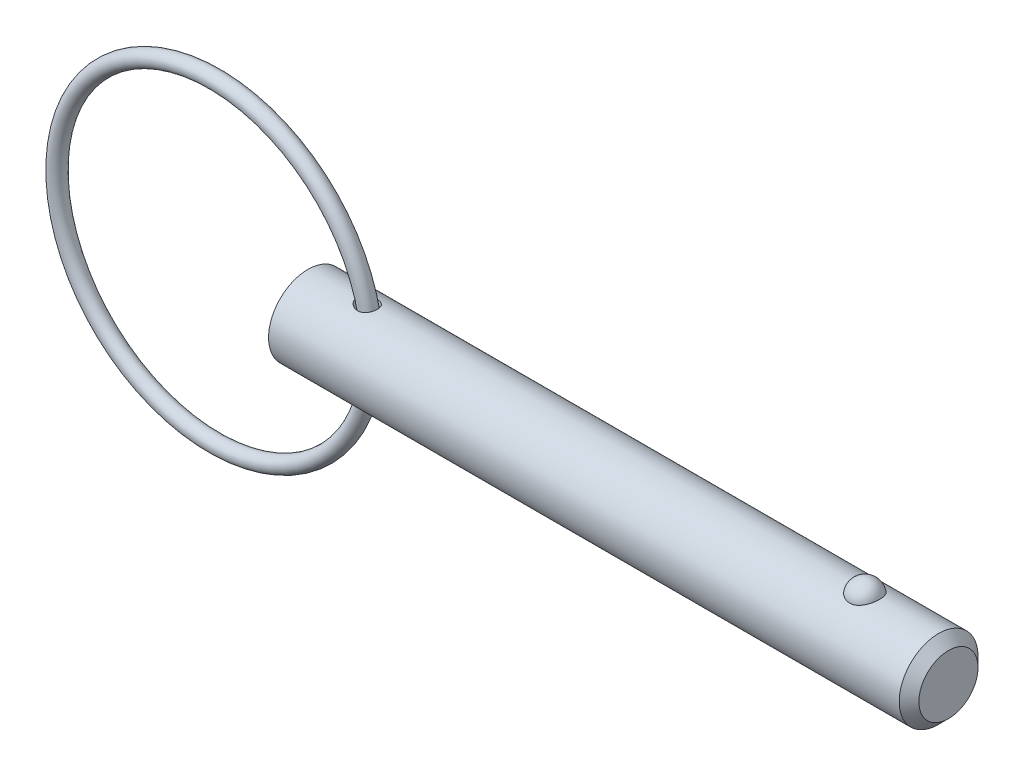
ISO-10303-21;
HEADER;
FILE_DESCRIPTION(('STEP AP214'),'2;1');
FILE_NAME('part.step','',(''),(''),'','','');
FILE_SCHEMA(('AUTOMOTIVE_DESIGN { 1 0 10303 214 1 1 1 1 }'));
ENDSEC;
DATA;
#1=APPLICATION_CONTEXT('core data for automotive mechanical design processes');
#2=APPLICATION_PROTOCOL_DEFINITION('international standard','automotive_design',2000,#1);
#3=PRODUCT_CONTEXT('',#1,'mechanical');
#4=PRODUCT('Part','Part','',(#3));
#5=PRODUCT_RELATED_PRODUCT_CATEGORY('part','',(#4));
#6=PRODUCT_DEFINITION_FORMATION('','',#4);
#7=PRODUCT_DEFINITION_CONTEXT('part definition',#1,'design');
#8=PRODUCT_DEFINITION('design','',#6,#7);
#9=PRODUCT_DEFINITION_SHAPE('','',#8);
#10=(LENGTH_UNIT() NAMED_UNIT(*) SI_UNIT(.MILLI.,.METRE.));
#11=(NAMED_UNIT(*) PLANE_ANGLE_UNIT() SI_UNIT($,.RADIAN.));
#12=(NAMED_UNIT(*) SI_UNIT($,.STERADIAN.) SOLID_ANGLE_UNIT());
#13=UNCERTAINTY_MEASURE_WITH_UNIT(LENGTH_MEASURE(1.E-05),#10,'distance_accuracy_value','');
#14=(GEOMETRIC_REPRESENTATION_CONTEXT(3) GLOBAL_UNCERTAINTY_ASSIGNED_CONTEXT((#13)) GLOBAL_UNIT_ASSIGNED_CONTEXT((#10,
#11,#12)) REPRESENTATION_CONTEXT('',''));
#15=CARTESIAN_POINT('',(0.,0.,0.));
#16=DIRECTION('',(0.,0.,1.));
#17=DIRECTION('',(1.,0.,0.));
#18=AXIS2_PLACEMENT_3D('',#15,#16,#17);
#19=CARTESIAN_POINT('',(-7.52490236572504,0.,0.));
#20=DIRECTION('',(0.,0.,1.));
#21=DIRECTION('',(1.,0.,0.));
#22=AXIS2_PLACEMENT_3D('',#19,#20,#21);
#23=TOROIDAL_SURFACE('',#22,12.7,0.635000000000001);
#24=CARTESIAN_POINT('',(5.81009763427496,0.,0.));
#25=VERTEX_POINT('',#24);
#26=VERTEX_LOOP('',#25);
#27=FACE_BOUND('',#26,.T.);
#28=ADVANCED_FACE('P0_F12',(#27),#23,.T.);
#29=CLOSED_SHELL('',(#28));
#30=MANIFOLD_SOLID_BREP('P0_B1',#29);
#31=CARTESIAN_POINT('',(0.,0.,0.));
#32=DIRECTION('',(1.,0.,0.));
#33=DIRECTION('',(0.,0.,-1.));
#34=AXIS2_PLACEMENT_3D('',#31,#32,#33);
#35=CYLINDRICAL_SURFACE('',#34,3.175);
#36=CARTESIAN_POINT('',(4.01221718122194,3.16142308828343,-0.293307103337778));
#37=CARTESIAN_POINT('',(4.03067993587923,3.15750982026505,-0.335477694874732));
#38=CARTESIAN_POINT('',(4.05297703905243,3.15289835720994,-0.375943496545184));
#39=CARTESIAN_POINT('',(4.10415276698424,3.14284099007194,-0.452407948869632));
#40=CARTESIAN_POINT('',(4.1330447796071,3.13739339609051,-0.488397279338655));
#41=CARTESIAN_POINT('',(4.19615348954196,3.12629932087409,-0.554988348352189));
#42=CARTESIAN_POINT('',(4.23034557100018,3.12065384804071,-0.585613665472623));
#43=CARTESIAN_POINT('',(4.3031328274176,3.10972452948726,-0.641123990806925));
#44=CARTESIAN_POINT('',(4.34172706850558,3.10444060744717,-0.666010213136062));
#45=CARTESIAN_POINT('',(4.42517725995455,3.09444053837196,-0.711079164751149));
#46=CARTESIAN_POINT('',(4.47028158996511,3.08978882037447,-0.730818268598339));
#47=CARTESIAN_POINT('',(4.56327045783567,3.08209858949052,-0.762602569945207));
#48=CARTESIAN_POINT('',(4.61115533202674,3.07906027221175,-0.774646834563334));
#49=CARTESIAN_POINT('',(4.70827322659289,3.0750396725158,-0.790458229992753));
#50=CARTESIAN_POINT('',(4.75750323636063,3.07405312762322,-0.79424252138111));
#51=CARTESIAN_POINT('',(4.85586074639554,3.07433427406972,-0.793155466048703));
#52=CARTESIAN_POINT('',(4.90498828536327,3.07560084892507,-0.788288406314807));
#53=CARTESIAN_POINT('',(4.99830385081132,3.08013122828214,-0.770385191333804));
#54=CARTESIAN_POINT('',(5.04260499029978,3.08325928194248,-0.757902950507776));
#55=CARTESIAN_POINT('',(5.1282462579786,3.09104671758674,-0.725486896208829));
#56=CARTESIAN_POINT('',(5.16958706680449,3.09570574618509,-0.705554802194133));
#57=CARTESIAN_POINT('',(5.24627719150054,3.10576748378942,-0.65981371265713));
#58=CARTESIAN_POINT('',(5.28181038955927,3.11112830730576,-0.634302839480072));
#59=CARTESIAN_POINT('',(5.34802604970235,3.12213947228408,-0.57766778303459));
#60=CARTESIAN_POINT('',(5.37870854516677,3.1277898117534,-0.546543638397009));
#61=CARTESIAN_POINT('',(5.43445707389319,3.13876145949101,-0.479533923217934));
#62=CARTESIAN_POINT('',(5.45951927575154,3.14408254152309,-0.443645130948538));
#63=CARTESIAN_POINT('',(5.50339935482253,3.15381660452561,-0.368122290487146));
#64=CARTESIAN_POINT('',(5.52221691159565,3.15822953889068,-0.328488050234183));
#65=CARTESIAN_POINT('',(5.55335622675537,3.16572312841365,-0.246075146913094));
#66=CARTESIAN_POINT('',(5.56559711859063,3.16878711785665,-0.203264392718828));
#67=CARTESIAN_POINT('',(5.58294807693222,3.17317503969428,-0.116135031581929));
#68=CARTESIAN_POINT('',(5.58805800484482,3.17449893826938,-0.0718163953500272));
#69=CARTESIAN_POINT('',(5.59103306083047,3.17526647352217,0.0172340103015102));
#70=CARTESIAN_POINT('',(5.58887304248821,3.17470358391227,0.0619666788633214));
#71=CARTESIAN_POINT('',(5.57730300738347,3.17174350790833,0.15042284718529));
#72=CARTESIAN_POINT('',(5.56789286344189,3.16934628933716,0.1941463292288));
#73=CARTESIAN_POINT('',(5.54204285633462,3.16297605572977,0.279344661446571));
#74=CARTESIAN_POINT('',(5.52560272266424,3.15900298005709,0.320819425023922));
#75=CARTESIAN_POINT('',(5.4860820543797,3.14991364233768,0.400340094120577));
#76=CARTESIAN_POINT('',(5.46300145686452,3.14479736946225,0.438385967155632));
#77=CARTESIAN_POINT('',(5.41080575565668,3.1339965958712,0.509900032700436));
#78=CARTESIAN_POINT('',(5.3817004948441,3.12831302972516,0.54337554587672));
#79=CARTESIAN_POINT('',(5.31818122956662,3.11701107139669,0.604852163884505));
#80=CARTESIAN_POINT('',(5.2837678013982,3.11139267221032,0.632853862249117));
#81=CARTESIAN_POINT('',(5.21096127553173,3.10091904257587,0.682320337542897));
#82=CARTESIAN_POINT('',(5.1726139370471,3.09605639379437,0.703850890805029));
#83=CARTESIAN_POINT('',(5.09274050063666,3.08756769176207,0.740203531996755));
#84=CARTESIAN_POINT('',(5.05121474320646,3.08394150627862,0.755026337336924));
#85=CARTESIAN_POINT('',(4.9665065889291,3.07833156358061,0.777582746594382));
#86=CARTESIAN_POINT('',(4.92333841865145,3.07633606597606,0.785367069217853));
#87=CARTESIAN_POINT('',(4.83627503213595,3.07411756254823,0.794006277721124));
#88=CARTESIAN_POINT('',(4.79237971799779,3.07389479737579,0.794860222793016));
#89=CARTESIAN_POINT('',(4.70375644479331,3.0752087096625,0.789761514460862));
#90=CARTESIAN_POINT('',(4.65904075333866,3.07679607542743,0.783612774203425));
#91=CARTESIAN_POINT('',(4.57116325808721,3.08158486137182,0.764561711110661));
#92=CARTESIAN_POINT('',(4.52800197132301,3.08478681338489,0.751657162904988));
#93=CARTESIAN_POINT('',(4.44149370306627,3.09268658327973,0.718486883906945));
#94=CARTESIAN_POINT('',(4.39831651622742,3.0974680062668,0.697797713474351));
#95=CARTESIAN_POINT('',(4.31591226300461,3.10789270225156,0.649792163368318));
#96=CARTESIAN_POINT('',(4.27668695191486,3.11353635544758,0.622472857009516));
#97=CARTESIAN_POINT('',(4.20182407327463,3.1252888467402,0.560557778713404));
#98=CARTESIAN_POINT('',(4.16638921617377,3.13140725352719,0.525717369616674));
#99=CARTESIAN_POINT('',(4.10227951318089,3.14315144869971,0.450199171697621));
#100=CARTESIAN_POINT('',(4.0736023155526,3.14877740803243,0.409523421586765));
#101=CARTESIAN_POINT('',(4.02575866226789,3.15851130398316,0.325741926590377));
#102=CARTESIAN_POINT('',(4.00615248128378,3.16268619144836,0.282896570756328));
#103=CARTESIAN_POINT('',(3.97532986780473,3.16936826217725,0.194163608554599));
#104=CARTESIAN_POINT('',(3.96410589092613,3.17187694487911,0.148278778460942));
#105=CARTESIAN_POINT('',(3.95155037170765,3.17469339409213,0.0604600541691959));
#106=CARTESIAN_POINT('',(3.9492378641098,3.17521926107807,0.0186712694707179));
#107=CARTESIAN_POINT('',(3.95191506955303,3.1746144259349,-0.0646295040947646));
#108=CARTESIAN_POINT('',(3.9568961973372,3.17348567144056,-0.10614176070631));
#109=CARTESIAN_POINT('',(3.97060099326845,3.17043701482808,-0.172031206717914));
#110=CARTESIAN_POINT('',(3.97717137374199,3.16898333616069,-0.196902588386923));
#111=CARTESIAN_POINT('',(3.99283717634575,3.16556630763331,-0.245794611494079));
#112=CARTESIAN_POINT('',(4.00193224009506,3.16360303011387,-0.269815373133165));
#113=CARTESIAN_POINT('',(4.01221718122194,3.16142308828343,-0.293307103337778));
#114=B_SPLINE_CURVE_WITH_KNOTS('',3,(#36,#37,#38,#39,#40,#41,#42,#43,#44,#45,#46,#47,#48,#49,
#50,#51,#52,#53,#54,#55,#56,#57,#58,#59,#60,#61,#62,#63,#64,#65,#66,#67,#68,#69,#70,#71,#72,#73,
#74,#75,#76,#77,#78,#79,#80,#81,#82,#83,#84,#85,#86,#87,#88,#89,#90,#91,#92,#93,#94,#95,#96,#97,
#98,#99,#100,#101,#102,#103,#104,#105,#106,#107,#108,#109,#110,#111,#112,#113),.UNSPECIFIED.,
.T.,.F.,(4,2,2,2,2,2,2,2,2,2,2,2,2,2,2,2,2,2,2,2,2,2,2,2,2,2,2,2,2,2,2,2,2,2,2,2,2,2,4),(0.,
0.138498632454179,0.277280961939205,0.415437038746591,0.553563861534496,0.701231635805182,
0.848917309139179,0.996295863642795,1.14360140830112,1.28129260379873,1.41895203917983,
1.55053732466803,1.68212170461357,1.81379551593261,1.94547608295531,2.07874074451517,
2.21200799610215,2.34573668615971,2.47946772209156,2.61320390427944,2.74694135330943,
2.8804620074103,3.01396817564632,3.14606745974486,3.27815261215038,3.40927820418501,
3.54042159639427,3.6753294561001,3.81028178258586,3.95399377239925,4.09776931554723,
4.24721954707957,4.39661769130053,4.53771923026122,4.67869361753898,4.8036143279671,
4.92838811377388,5.00555170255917,5.08270434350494),.UNSPECIFIED.);
#115=CARTESIAN_POINT('',(4.01221718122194,3.16142308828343,-0.293307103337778));
#116=VERTEX_POINT('',#115);
#117=EDGE_CURVE('P1_E40',#116,#116,#114,.T.);
#118=ORIENTED_EDGE('',*,*,#117,.T.);
#119=EDGE_LOOP('',(#118));
#120=FACE_BOUND('',#119,.T.);
#121=CARTESIAN_POINT('',(50.81625,0.,0.));
#122=DIRECTION('',(1.,0.,0.));
#123=DIRECTION('',(0.,0.,-1.));
#124=AXIS2_PLACEMENT_3D('',#121,#122,#123);
#125=CIRCLE('',#124,3.175);
#126=CARTESIAN_POINT('',(50.81625,0.,-3.175));
#127=VERTEX_POINT('',#126);
#128=EDGE_CURVE('P1_E25',#127,#127,#125,.T.);
#129=ORIENTED_EDGE('',*,*,#128,.F.);
#130=EDGE_LOOP('',(#129));
#131=FACE_BOUND('',#130,.T.);
#132=CARTESIAN_POINT('',(0.,0.,0.));
#133=DIRECTION('',(1.,0.,0.));
#134=DIRECTION('',(0.,0.,-1.));
#135=AXIS2_PLACEMENT_3D('',#132,#133,#134);
#136=CIRCLE('',#135,3.175);
#137=CARTESIAN_POINT('',(0.,0.,-3.175));
#138=VERTEX_POINT('',#137);
#139=EDGE_CURVE('P1_E9',#138,#138,#136,.T.);
#140=ORIENTED_EDGE('',*,*,#139,.T.);
#141=EDGE_LOOP('',(#140));
#142=FACE_BOUND('',#141,.T.);
#143=CARTESIAN_POINT('',(44.8757276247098,2.92898950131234,1.2254164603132));
#144=CARTESIAN_POINT('',(44.812316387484,2.92899434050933,1.22541146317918));
#145=CARTESIAN_POINT('',(44.7487979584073,2.93112688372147,1.22034641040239));
#146=CARTESIAN_POINT('',(44.6235306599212,2.93942752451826,1.2002094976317));
#147=CARTESIAN_POINT('',(44.5617869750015,2.9456063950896,1.1851109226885));
#148=CARTESIAN_POINT('',(44.4420651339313,2.96127115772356,1.14540352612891));
#149=CARTESIAN_POINT('',(44.3840775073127,2.97074831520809,1.12081980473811));
#150=CARTESIAN_POINT('',(44.2731943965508,2.99197584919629,1.06285154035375));
#151=CARTESIAN_POINT('',(44.2202966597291,3.0037252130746,1.02947091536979));
#152=CARTESIAN_POINT('',(44.1192688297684,3.02865714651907,0.95367409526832));
#153=CARTESIAN_POINT('',(44.071324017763,3.04187163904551,0.911021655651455));
#154=CARTESIAN_POINT('',(43.9830360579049,3.06808741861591,0.818400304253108));
#155=CARTESIAN_POINT('',(43.9426952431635,3.08108863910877,0.768429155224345));
#156=CARTESIAN_POINT('',(43.8688039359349,3.10614903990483,0.660064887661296));
#157=CARTESIAN_POINT('',(43.8356330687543,3.11814104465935,0.60139688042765));
#158=CARTESIAN_POINT('',(43.7791190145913,3.13926931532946,0.479026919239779));
#159=CARTESIAN_POINT('',(43.7557764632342,3.14840539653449,0.415324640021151));
#160=CARTESIAN_POINT('',(43.7191785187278,3.16298160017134,0.283885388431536));
#161=CARTESIAN_POINT('',(43.7060407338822,3.16837855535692,0.216110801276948));
#162=CARTESIAN_POINT('',(43.6905676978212,3.17475386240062,0.0791367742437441));
#163=CARTESIAN_POINT('',(43.688232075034,3.17573236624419,0.00993738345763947));
#164=CARTESIAN_POINT('',(43.694388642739,3.17318075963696,-0.127420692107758));
#165=CARTESIAN_POINT('',(43.7028073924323,3.16968122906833,-0.195583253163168));
#166=CARTESIAN_POINT('',(43.7301752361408,3.1585790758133,-0.329413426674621));
#167=CARTESIAN_POINT('',(43.7491245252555,3.15097637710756,-0.395080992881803));
#168=CARTESIAN_POINT('',(43.7972057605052,3.13242485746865,-0.522180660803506));
#169=CARTESIAN_POINT('',(43.8263524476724,3.12147119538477,-0.583606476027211));
#170=CARTESIAN_POINT('',(43.8942352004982,3.09734973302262,-0.700436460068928));
#171=CARTESIAN_POINT('',(43.932972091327,3.08418174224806,-0.7558401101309));
#172=CARTESIAN_POINT('',(44.0194771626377,3.05694884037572,-0.859404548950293));
#173=CARTESIAN_POINT('',(44.0672961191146,3.04287919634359,-0.90752174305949));
#174=CARTESIAN_POINT('',(44.1707353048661,3.01548927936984,-0.994758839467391));
#175=CARTESIAN_POINT('',(44.2263549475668,3.0021689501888,-1.03387941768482));
#176=CARTESIAN_POINT('',(44.3428093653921,2.97810316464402,-1.10126594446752));
#177=CARTESIAN_POINT('',(44.4035182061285,2.96731170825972,-1.12973256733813));
#178=CARTESIAN_POINT('',(44.5293712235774,2.94928934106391,-1.17598467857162));
#179=CARTESIAN_POINT('',(44.5945137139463,2.94205708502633,-1.19377420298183));
#180=CARTESIAN_POINT('',(44.7238562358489,2.93233065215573,-1.21746387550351));
#181=CARTESIAN_POINT('',(44.7879385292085,2.92961621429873,-1.22391763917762));
#182=CARTESIAN_POINT('',(44.9163375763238,2.92855752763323,-1.22644976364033));
#183=CARTESIAN_POINT('',(44.9806542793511,2.93021238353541,-1.22253024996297));
#184=CARTESIAN_POINT('',(45.1055239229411,2.93756851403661,-1.20474140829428));
#185=CARTESIAN_POINT('',(45.166131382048,2.94313790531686,-1.1911962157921));
#186=CARTESIAN_POINT('',(45.2841106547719,2.95756226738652,-1.15491492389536));
#187=CARTESIAN_POINT('',(45.3414822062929,2.96641750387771,-1.13217808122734));
#188=CARTESIAN_POINT('',(45.4527699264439,2.98669918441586,-1.07755083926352));
#189=CARTESIAN_POINT('',(45.5065845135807,2.9981771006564,-1.04547308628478));
#190=CARTESIAN_POINT('',(45.6081473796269,3.02240235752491,-0.973220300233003));
#191=CARTESIAN_POINT('',(45.6558942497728,3.03514999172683,-0.933043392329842));
#192=CARTESIAN_POINT('',(45.7465817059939,3.06131230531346,-0.843372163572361));
#193=CARTESIAN_POINT('',(45.7891588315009,3.07472822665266,-0.793510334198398));
#194=CARTESIAN_POINT('',(45.8656765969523,3.10021106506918,-0.687241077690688));
#195=CARTESIAN_POINT('',(45.8996156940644,3.1122777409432,-0.630832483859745));
#196=CARTESIAN_POINT('',(45.9591209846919,3.134208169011,-0.51105938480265));
#197=CARTESIAN_POINT('',(45.9843892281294,3.14399040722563,-0.4475315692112));
#198=CARTESIAN_POINT('',(46.0245117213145,3.15983820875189,-0.316827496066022));
#199=CARTESIAN_POINT('',(46.0393659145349,3.16590375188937,-0.249651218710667));
#200=CARTESIAN_POINT('',(46.058358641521,3.17370076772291,-0.113549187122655));
#201=CARTESIAN_POINT('',(46.0624966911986,3.17543204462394,-0.0446233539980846));
#202=CARTESIAN_POINT('',(46.0599697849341,3.17438372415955,0.0929938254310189));
#203=CARTESIAN_POINT('',(46.0533050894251,3.17160423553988,0.161685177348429));
#204=CARTESIAN_POINT('',(46.0293754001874,3.1618438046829,0.296502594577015));
#205=CARTESIAN_POINT('',(46.0121674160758,3.15488546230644,0.36264043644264));
#206=CARTESIAN_POINT('',(45.967547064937,3.13748892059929,0.490896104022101));
#207=CARTESIAN_POINT('',(45.9401339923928,3.12705048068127,0.553013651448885));
#208=CARTESIAN_POINT('',(45.8754626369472,3.10369139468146,0.671876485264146));
#209=CARTESIAN_POINT('',(45.8381467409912,3.0907563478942,0.728587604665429));
#210=CARTESIAN_POINT('',(45.7545246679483,3.06381731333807,0.834653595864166));
#211=CARTESIAN_POINT('',(45.7082189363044,3.04981337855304,0.884008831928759));
#212=CARTESIAN_POINT('',(45.6077184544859,3.02230423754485,0.973916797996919));
#213=CARTESIAN_POINT('',(45.553535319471,3.00879833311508,1.01448227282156));
#214=CARTESIAN_POINT('',(45.4385299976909,2.98383625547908,1.08571550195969));
#215=CARTESIAN_POINT('',(45.3777053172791,2.9723808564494,1.11637952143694));
#216=CARTESIAN_POINT('',(45.2533690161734,2.95329063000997,1.16592590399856));
#217=CARTESIAN_POINT('',(45.1900230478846,2.9455373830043,1.18517901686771));
#218=CARTESIAN_POINT('',(45.0607664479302,2.9342556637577,1.21284802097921));
#219=CARTESIAN_POINT('',(44.9948641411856,2.93071450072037,1.2212964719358));
#220=CARTESIAN_POINT('',(44.911116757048,2.9291525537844,1.22502505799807));
#221=CARTESIAN_POINT('',(44.8934263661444,2.9289881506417,1.22541785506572));
#222=CARTESIAN_POINT('',(44.8757276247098,2.92898950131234,1.2254164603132));
#223=B_SPLINE_CURVE_WITH_KNOTS('',3,(#143,#144,#145,#146,#147,#148,#149,#150,#151,#152,#153,
#154,#155,#156,#157,#158,#159,#160,#161,#162,#163,#164,#165,#166,#167,#168,#169,#170,#171,#172,
#173,#174,#175,#176,#177,#178,#179,#180,#181,#182,#183,#184,#185,#186,#187,#188,#189,#190,#191,
#192,#193,#194,#195,#196,#197,#198,#199,#200,#201,#202,#203,#204,#205,#206,#207,#208,#209,#210,
#211,#212,#213,#214,#215,#216,#217,#218,#219,#220,#221,#222),.UNSPECIFIED.,.T.,.F.,(4,2,2,2,2,2,
2,2,2,2,2,2,2,2,2,2,2,2,2,2,2,2,2,2,2,2,2,2,2,2,2,2,2,2,2,2,2,2,2,4),(0.,0.190186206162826,
0.380880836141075,0.571074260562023,0.761183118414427,0.95686644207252,1.1526097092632,
1.35701770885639,1.56143892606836,1.76818248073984,1.97491892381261,2.18025109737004,
2.38558707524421,2.59122111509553,2.79687285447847,3.00371012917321,3.21053185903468,
3.41323429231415,3.61586005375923,3.80828192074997,4.00066436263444,4.18685798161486,
4.37306665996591,4.56330302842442,4.75358348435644,4.95345287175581,5.15335793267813,
5.35957003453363,5.56578325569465,5.77200579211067,5.97822335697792,6.18333558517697,
6.38846199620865,6.59480900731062,6.80114579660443,7.00718137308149,7.21329457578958,
7.41228022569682,7.61066481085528,7.66374777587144),.UNSPECIFIED.);
#224=CARTESIAN_POINT('',(44.8757276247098,2.92898950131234,1.2254164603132));
#225=VERTEX_POINT('',#224);
#226=EDGE_CURVE('P1_E34',#225,#225,#223,.T.);
#227=ORIENTED_EDGE('',*,*,#226,.T.);
#228=EDGE_LOOP('',(#227));
#229=FACE_BOUND('',#228,.T.);
#230=CARTESIAN_POINT('',(4.01221718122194,-3.16142308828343,-0.293307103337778));
#231=CARTESIAN_POINT('',(3.99616924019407,-3.16482429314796,-0.256648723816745));
#232=CARTESIAN_POINT('',(3.9830087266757,-3.16769953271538,-0.218679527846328));
#233=CARTESIAN_POINT('',(3.96305928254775,-3.17210414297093,-0.141027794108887));
#234=CARTESIAN_POINT('',(3.95626715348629,-3.17363418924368,-0.101346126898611));
#235=CARTESIAN_POINT('',(3.94940055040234,-3.17518116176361,-0.0213063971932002));
#236=CARTESIAN_POINT('',(3.94933713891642,-3.17519559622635,0.0190526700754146));
#237=CARTESIAN_POINT('',(3.95595884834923,-3.173703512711,0.0991848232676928));
#238=CARTESIAN_POINT('',(3.96264478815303,-3.17219681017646,0.138957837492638));
#239=CARTESIAN_POINT('',(3.98225001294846,-3.16786598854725,0.216153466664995));
#240=CARTESIAN_POINT('',(3.99506606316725,-3.16506371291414,0.253603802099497));
#241=CARTESIAN_POINT('',(4.0263107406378,-3.15843101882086,0.325977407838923));
#242=CARTESIAN_POINT('',(4.04474073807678,-3.15460034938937,0.360900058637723));
#243=CARTESIAN_POINT('',(4.0879644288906,-3.14597426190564,0.429836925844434));
#244=CARTESIAN_POINT('',(4.1131071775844,-3.1411307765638,0.463625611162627));
#245=CARTESIAN_POINT('',(4.16818460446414,-3.13112506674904,0.526983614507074));
#246=CARTESIAN_POINT('',(4.1981214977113,-3.1259626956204,0.556550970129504));
#247=CARTESIAN_POINT('',(4.26550089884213,-3.11521604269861,0.614003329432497));
#248=CARTESIAN_POINT('',(4.3034063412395,-3.10964747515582,0.641349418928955));
#249=CARTESIAN_POINT('',(4.38313680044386,-3.09926692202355,0.68977116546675));
#250=CARTESIAN_POINT('',(4.42496355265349,-3.09445527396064,0.710844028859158));
#251=CARTESIAN_POINT('',(4.51417855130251,-3.08586578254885,0.747282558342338));
#252=CARTESIAN_POINT('',(4.56175044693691,-3.08216903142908,0.762221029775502));
#253=CARTESIAN_POINT('',(4.6588493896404,-3.076742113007,0.783842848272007));
#254=CARTESIAN_POINT('',(4.70837600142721,-3.07501151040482,0.790528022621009));
#255=CARTESIAN_POINT('',(4.80630979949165,-3.07383938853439,0.7950736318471));
#256=CARTESIAN_POINT('',(4.85470314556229,-3.07432752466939,0.793205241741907));
#257=CARTESIAN_POINT('',(4.95034305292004,-3.07744489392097,0.781023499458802));
#258=CARTESIAN_POINT('',(4.99759012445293,-3.0800731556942,0.770713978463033));
#259=CARTESIAN_POINT('',(5.08626194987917,-3.08693276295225,0.742738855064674));
#260=CARTESIAN_POINT('',(5.1278649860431,-3.09104603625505,0.725607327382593));
#261=CARTESIAN_POINT('',(5.20739903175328,-3.10040746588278,0.684500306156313));
#262=CARTESIAN_POINT('',(5.24533051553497,-3.10565547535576,0.660525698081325));
#263=CARTESIAN_POINT('',(5.31542898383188,-3.11652031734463,0.607160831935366));
#264=CARTESIAN_POINT('',(5.34772618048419,-3.12212297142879,0.577938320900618));
#265=CARTESIAN_POINT('',(5.40696901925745,-3.13320503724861,0.51447712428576));
#266=CARTESIAN_POINT('',(5.43391452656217,-3.13868444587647,0.48023831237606));
#267=CARTESIAN_POINT('',(5.4820017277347,-3.14897211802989,0.407384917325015));
#268=CARTESIAN_POINT('',(5.50309185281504,-3.15377424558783,0.368735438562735));
#269=CARTESIAN_POINT('',(5.53866240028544,-3.16213411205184,0.288380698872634));
#270=CARTESIAN_POINT('',(5.55314252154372,-3.16569179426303,0.246675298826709));
#271=CARTESIAN_POINT('',(5.57526489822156,-3.17121134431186,0.160950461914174));
#272=CARTESIAN_POINT('',(5.58283917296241,-3.17315732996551,0.116912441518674));
#273=CARTESIAN_POINT('',(5.59072863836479,-3.17518554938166,0.0281485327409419));
#274=CARTESIAN_POINT('',(5.59104374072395,-3.17526776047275,-0.0165773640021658));
#275=CARTESIAN_POINT('',(5.58440302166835,-3.17355847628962,-0.105510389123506));
#276=CARTESIAN_POINT('',(5.57743745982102,-3.17176447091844,-0.149716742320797));
#277=CARTESIAN_POINT('',(5.55638330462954,-3.16649194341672,-0.236295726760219));
#278=CARTESIAN_POINT('',(5.54229454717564,-3.16301338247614,-0.278668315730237));
#279=CARTESIAN_POINT('',(5.50732506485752,-3.15474878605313,-0.360378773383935));
#280=CARTESIAN_POINT('',(5.48644386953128,-3.14996266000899,-0.399716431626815));
#281=CARTESIAN_POINT('',(5.43839310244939,-3.13960947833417,-0.474229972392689));
#282=CARTESIAN_POINT('',(5.41122365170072,-3.1340424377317,-0.509405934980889));
#283=CARTESIAN_POINT('',(5.35140258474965,-3.12277449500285,-0.574449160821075));
#284=CARTESIAN_POINT('',(5.31877354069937,-3.11707422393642,-0.604337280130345));
#285=CARTESIAN_POINT('',(5.24883067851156,-3.10616541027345,-0.658116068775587));
#286=CARTESIAN_POINT('',(5.21151752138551,-3.1009567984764,-0.682007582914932));
#287=CARTESIAN_POINT('',(5.13375489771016,-3.09168295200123,-0.722881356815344));
#288=CARTESIAN_POINT('',(5.09335030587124,-3.0876042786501,-0.739946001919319));
#289=CARTESIAN_POINT('',(5.0101742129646,-3.08094605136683,-0.767199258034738));
#290=CARTESIAN_POINT('',(4.96740279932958,-3.07836644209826,-0.777388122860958));
#291=CARTESIAN_POINT('',(4.88066362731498,-3.07495302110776,-0.790782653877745));
#292=CARTESIAN_POINT('',(4.8366943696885,-3.07412150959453,-0.793979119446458));
#293=CARTESIAN_POINT('',(4.74880185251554,-3.07424620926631,-0.793495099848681));
#294=CARTESIAN_POINT('',(4.70487860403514,-3.07520278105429,-0.789813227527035));
#295=CARTESIAN_POINT('',(4.61626456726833,-3.07882608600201,-0.775571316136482));
#296=CARTESIAN_POINT('',(4.57162423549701,-3.08156578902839,-0.764717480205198));
#297=CARTESIAN_POINT('',(4.48464592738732,-3.08847909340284,-0.736297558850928));
#298=CARTESIAN_POINT('',(4.44230893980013,-3.09265330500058,-0.718728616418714));
#299=CARTESIAN_POINT('',(4.35823256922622,-3.10228551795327,-0.675988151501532));
#300=CARTESIAN_POINT('',(4.31671586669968,-3.10780992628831,-0.650392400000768));
#301=CARTESIAN_POINT('',(4.23853942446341,-3.11932897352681,-0.592684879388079));
#302=CARTESIAN_POINT('',(4.20188053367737,-3.12532369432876,-0.560571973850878));
#303=CARTESIAN_POINT('',(4.13583653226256,-3.13687565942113,-0.491740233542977));
#304=CARTESIAN_POINT('',(4.10623659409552,-3.14244088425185,-0.45522955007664));
#305=CARTESIAN_POINT('',(4.05384351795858,-3.1527191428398,-0.377513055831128));
#306=CARTESIAN_POINT('',(4.03104346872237,-3.1574330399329,-0.336312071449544));
#307=CARTESIAN_POINT('',(4.01221718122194,-3.16142308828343,-0.293307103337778));
#308=B_SPLINE_CURVE_WITH_KNOTS('',3,(#230,#231,#232,#233,#234,#235,#236,#237,#238,#239,#240,
#241,#242,#243,#244,#245,#246,#247,#248,#249,#250,#251,#252,#253,#254,#255,#256,#257,#258,#259,
#260,#261,#262,#263,#264,#265,#266,#267,#268,#269,#270,#271,#272,#273,#274,#275,#276,#277,#278,
#279,#280,#281,#282,#283,#284,#285,#286,#287,#288,#289,#290,#291,#292,#293,#294,#295,#296,#297,
#298,#299,#300,#301,#302,#303,#304,#305,#306,#307),.UNSPECIFIED.,.T.,.F.,(4,2,2,2,2,2,2,2,2,2,2,
2,2,2,2,2,2,2,2,2,2,2,2,2,2,2,2,2,2,2,2,2,2,2,2,2,2,2,4),(0.,0.120338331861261,
0.240616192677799,0.361091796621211,0.481582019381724,0.60011096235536,0.718668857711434,
0.845336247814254,0.972062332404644,1.1126676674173,1.25333552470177,1.40259505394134,
1.55182153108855,1.69635040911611,1.84081372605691,1.97568175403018,2.11053233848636,
2.24166080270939,2.37279256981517,2.50504501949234,2.63730349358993,2.77085027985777,
2.90439869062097,3.03812599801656,3.17185638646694,3.30559603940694,3.43933311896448,
3.57253035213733,3.70570880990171,3.83722775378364,3.96874184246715,4.10042887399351,
4.23214246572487,4.36961700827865,4.5071501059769,4.65373408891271,4.8003436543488,
4.94166003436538,5.08283228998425),.UNSPECIFIED.);
#309=CARTESIAN_POINT('',(4.01221718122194,-3.16142308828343,-0.293307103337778));
#310=VERTEX_POINT('',#309);
#311=EDGE_CURVE('P1_E17',#310,#310,#308,.T.);
#312=ORIENTED_EDGE('',*,*,#311,.T.);
#313=EDGE_LOOP('',(#312));
#314=FACE_BOUND('',#313,.T.);
#315=ADVANCED_FACE('P1_F13',(#120,#131,#142,#229,#314),#35,.T.);
#316=CARTESIAN_POINT('',(0.,0.,0.));
#317=DIRECTION('',(-1.,0.,0.));
#318=DIRECTION('',(0.,0.,1.));
#319=AXIS2_PLACEMENT_3D('',#316,#317,#318);
#320=PLANE('',#319);
#321=ORIENTED_EDGE('',*,*,#139,.F.);
#322=EDGE_LOOP('',(#321));
#323=FACE_BOUND('',#322,.T.);
#324=ADVANCED_FACE('P1_F15',(#323),#320,.T.);
#325=CARTESIAN_POINT('',(51.61,0.,0.));
#326=DIRECTION('',(-1.,0.,0.));
#327=DIRECTION('',(0.,0.,1.));
#328=AXIS2_PLACEMENT_3D('',#325,#326,#327);
#329=CONICAL_SURFACE('',#328,2.38125000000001,0.785398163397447);
#330=ORIENTED_EDGE('',*,*,#128,.T.);
#331=EDGE_LOOP('',(#330));
#332=FACE_BOUND('',#331,.T.);
#333=CARTESIAN_POINT('',(51.61,0.,0.));
#334=DIRECTION('',(1.,0.,0.));
#335=DIRECTION('',(0.,0.,-1.));
#336=AXIS2_PLACEMENT_3D('',#333,#334,#335);
#337=CIRCLE('',#336,2.38125000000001);
#338=CARTESIAN_POINT('',(51.61,0.,-2.38125000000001));
#339=VERTEX_POINT('',#338);
#340=EDGE_CURVE('P1_E30',#339,#339,#337,.T.);
#341=ORIENTED_EDGE('',*,*,#340,.F.);
#342=EDGE_LOOP('',(#341));
#343=FACE_BOUND('',#342,.T.);
#344=ADVANCED_FACE('P1_F55',(#332,#343),#329,.T.);
#345=CARTESIAN_POINT('',(51.61,2.38125000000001,0.));
#346=DIRECTION('',(1.,0.,0.));
#347=DIRECTION('',(0.,0.,-1.));
#348=AXIS2_PLACEMENT_3D('',#345,#346,#347);
#349=PLANE('',#348);
#350=ORIENTED_EDGE('',*,*,#340,.T.);
#351=EDGE_LOOP('',(#350));
#352=FACE_BOUND('',#351,.T.);
#353=ADVANCED_FACE('P1_F51',(#352),#349,.T.);
#354=CARTESIAN_POINT('',(44.8757276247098,2.8575,0.));
#355=DIRECTION('',(-1.,0.,0.));
#356=DIRECTION('',(0.,1.,0.));
#357=AXIS2_PLACEMENT_3D('',#354,#355,#356);
#358=SPHERICAL_SURFACE('',#357,1.2275);
#359=ORIENTED_EDGE('',*,*,#226,.F.);
#360=EDGE_LOOP('',(#359));
#361=FACE_BOUND('',#360,.T.);
#362=ADVANCED_FACE('P1_F46',(#361),#358,.T.);
#363=CARTESIAN_POINT('',(-7.52490236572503,0.,0.));
#364=DIRECTION('',(0.,0.,1.));
#365=DIRECTION('',(1.,0.,0.));
#366=AXIS2_PLACEMENT_3D('',#363,#364,#365);
#367=TOROIDAL_SURFACE('',#366,12.7,0.79375);
#368=ORIENTED_EDGE('',*,*,#311,.F.);
#369=EDGE_LOOP('',(#368));
#370=FACE_BOUND('',#369,.T.);
#371=ORIENTED_EDGE('',*,*,#117,.F.);
#372=EDGE_LOOP('',(#371));
#373=FACE_BOUND('',#372,.T.);
#374=ADVANCED_FACE('P1_F50',(#370,#373),#367,.F.);
#375=CLOSED_SHELL('',(#315,#324,#344,#353,#362,#374));
#376=MANIFOLD_SOLID_BREP('P1_B1',#375);
#377=ADVANCED_BREP_SHAPE_REPRESENTATION('',(#18,#30,#376),#14);
#378=SHAPE_DEFINITION_REPRESENTATION(#9,#377);
ENDSEC;
END-ISO-10303-21;
